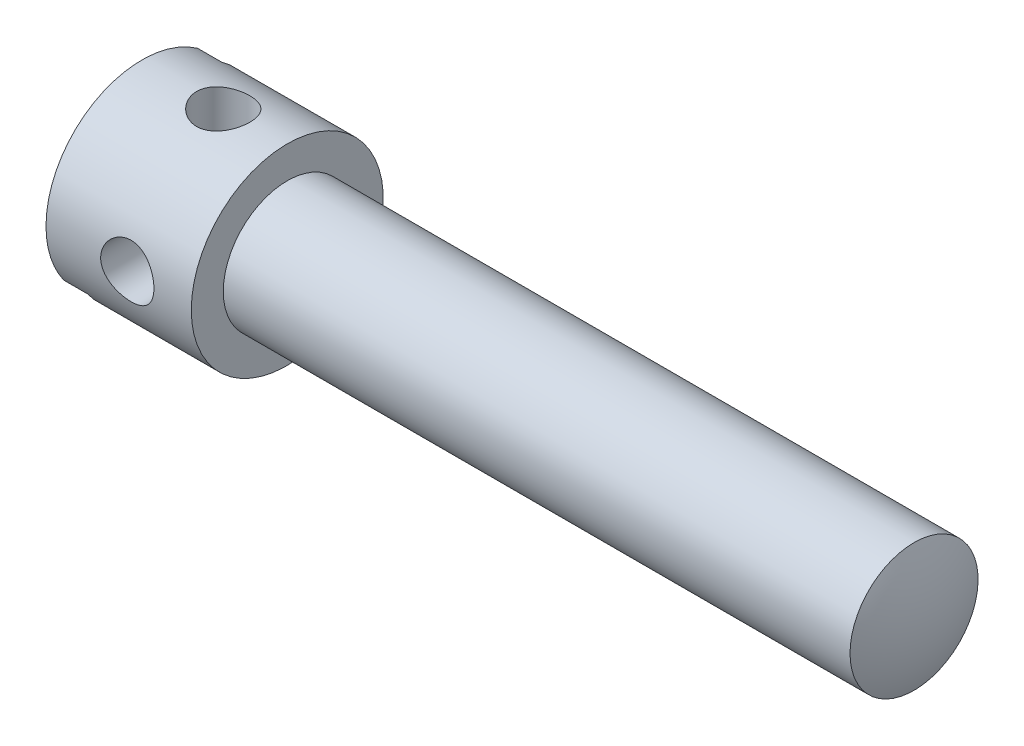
from build123d import *

# Parameters (mm, degrees)
SKETCH2_R          = 5
NECK_DEPTH         = 50
SKETCH5_R          = 2.08
CUT_EXTRUDE1_DEPTH = 70
SKETCH6_R          = 2.08
CUT_EXTRUDE2_DEPTH = 70
SKETCH7_W          = 3
SKETCH7_H          = 2.5
CUT_EXTRUDE3_DEPTH = 70


with BuildPart() as part:
    # Sketch1 → BaseHead (revolve)
    with BuildSketch(Plane.XY):
        with BuildLine():
            Line((1.151519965, 7.5), (12.5, 7.5))
            Line((12.5, 7.5), (12.5, 0))
            Line((12.5, 0), (0, 0))
            ThreePointArc((0, 0), (0.289556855, 3.793942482), (1.151519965, 7.5))
        make_face()
    revolve(axis=Axis((-25.059543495, 0, 0), (1, 0, 0)))

    # Sketch2 → Neck (add)
    with BuildSketch(Plane(origin=(12.5, 3.614329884, 0.195577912), x_dir=(0, 0, -1), z_dir=(1, 0, 0))):
        with Locations(Location((0.195577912, -3.614329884, 0), (0, 0, 180))):
            Circle(SKETCH2_R)
    extrude(amount=NECK_DEPTH)

    # Sketch4 → Cut-Revolve1 (revolve, cut)
    with BuildSketch(Plane.XY, mode=Mode.PRIVATE) as cut_revolve1_sk:
        with BuildLine():
            Line((50, 12.5), (50, 17.5))
            Line((50, 17.5), (67.5, 17.5))
            Line((67.5, 17.5), (67.5, 0))
            Line((67.5, 0), (62.5, 0))
            ThreePointArc((62.5, 0), (58.838834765, 8.838834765), (50, 12.5))
        make_face()
    revolve(cut_revolve1_sk.sketch.rotate(Axis((61.414233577, 0, 0), (-1, 0, 0)), 270), axis=Axis((61.414233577, 0, 0), (-1, 0, 0)), mode=Mode.SUBTRACT)

    # Sketch5 → Cut-Extrude1 (cut, symmetric)
    with BuildSketch(Plane.XY):
        with Locations((7.5, 0)):
            Circle(SKETCH5_R)
    extrude(amount=CUT_EXTRUDE1_DEPTH, both=True, mode=Mode.SUBTRACT)

    # Sketch6 → Cut-Extrude2 (cut, symmetric)
    with BuildSketch(Plane(origin=(0, 0, 0), x_dir=(1, 0, 0), z_dir=(0, 1, 0))):
        with Locations(Location((7.5, 0, 0), (0, 0, 270))):
            Circle(SKETCH6_R)
    extrude(amount=CUT_EXTRUDE2_DEPTH, both=True, mode=Mode.SUBTRACT)

    # Sketch7 → Cut-Extrude3 (cut, symmetric)
    with BuildSketch(Plane(origin=(0, 0, 0), x_dir=(1, 0, 0), z_dir=(0, -0.7071067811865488, 0.7071067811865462))):
        with Locations((1.5, 0)):
            Rectangle(SKETCH7_W, SKETCH7_H)
    extrude(amount=CUT_EXTRUDE3_DEPTH, both=True, mode=Mode.SUBTRACT)


solid = part.part
